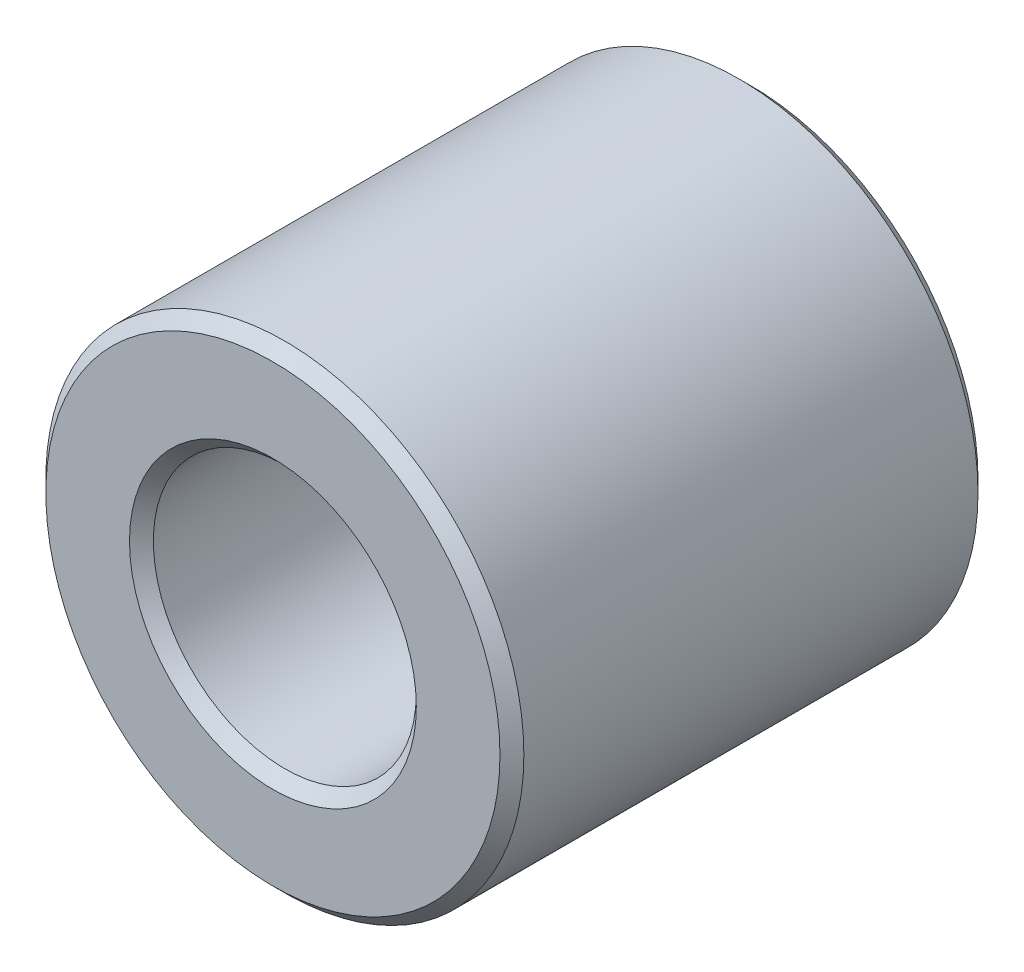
ISO-10303-21;
HEADER;
FILE_DESCRIPTION(('STEP AP214'),'2;1');
FILE_NAME('part.step','',(''),(''),'','','');
FILE_SCHEMA(('AUTOMOTIVE_DESIGN { 1 0 10303 214 1 1 1 1 }'));
ENDSEC;
DATA;
#1=APPLICATION_CONTEXT('core data for automotive mechanical design processes');
#2=APPLICATION_PROTOCOL_DEFINITION('international standard','automotive_design',2000,#1);
#3=PRODUCT_CONTEXT('',#1,'mechanical');
#4=PRODUCT('Part','Part','',(#3));
#5=PRODUCT_RELATED_PRODUCT_CATEGORY('part','',(#4));
#6=PRODUCT_DEFINITION_FORMATION('','',#4);
#7=PRODUCT_DEFINITION_CONTEXT('part definition',#1,'design');
#8=PRODUCT_DEFINITION('design','',#6,#7);
#9=PRODUCT_DEFINITION_SHAPE('','',#8);
#10=(LENGTH_UNIT() NAMED_UNIT(*) SI_UNIT(.MILLI.,.METRE.));
#11=(NAMED_UNIT(*) PLANE_ANGLE_UNIT() SI_UNIT($,.RADIAN.));
#12=(NAMED_UNIT(*) SI_UNIT($,.STERADIAN.) SOLID_ANGLE_UNIT());
#13=UNCERTAINTY_MEASURE_WITH_UNIT(LENGTH_MEASURE(1.E-05),#10,'distance_accuracy_value','');
#14=(GEOMETRIC_REPRESENTATION_CONTEXT(3) GLOBAL_UNCERTAINTY_ASSIGNED_CONTEXT((#13)) GLOBAL_UNIT_ASSIGNED_CONTEXT((#10,
#11,#12)) REPRESENTATION_CONTEXT('',''));
#15=CARTESIAN_POINT('',(0.,0.,0.));
#16=DIRECTION('',(0.,0.,1.));
#17=DIRECTION('',(1.,0.,0.));
#18=AXIS2_PLACEMENT_3D('',#15,#16,#17);
#19=CARTESIAN_POINT('',(0.,0.,2.));
#20=DIRECTION('',(0.,0.,1.));
#21=DIRECTION('',(1.,0.,0.));
#22=AXIS2_PLACEMENT_3D('',#19,#20,#21);
#23=PLANE('',#22);
#24=CARTESIAN_POINT('',(0.,0.,2.));
#25=DIRECTION('',(0.,0.,1.));
#26=DIRECTION('',(1.,0.,0.));
#27=AXIS2_PLACEMENT_3D('',#24,#25,#26);
#28=CIRCLE('',#27,1.2);
#29=CARTESIAN_POINT('',(1.2,0.,2.));
#30=VERTEX_POINT('',#29);
#31=EDGE_CURVE('E10',#30,#30,#28,.F.);
#32=ORIENTED_EDGE('',*,*,#31,.T.);
#33=EDGE_LOOP('',(#32));
#34=FACE_BOUND('',#33,.T.);
#35=CARTESIAN_POINT('',(0.,0.,2.));
#36=DIRECTION('',(0.,0.,1.));
#37=DIRECTION('',(1.,0.,0.));
#38=AXIS2_PLACEMENT_3D('',#35,#36,#37);
#39=CIRCLE('',#38,1.9);
#40=CARTESIAN_POINT('',(1.9,0.,2.));
#41=VERTEX_POINT('',#40);
#42=EDGE_CURVE('E45',#41,#41,#39,.T.);
#43=ORIENTED_EDGE('',*,*,#42,.T.);
#44=EDGE_LOOP('',(#43));
#45=FACE_BOUND('',#44,.T.);
#46=ADVANCED_FACE('F37',(#34,#45),#23,.T.);
#47=CARTESIAN_POINT('',(0.,0.,-2.));
#48=DIRECTION('',(0.,0.,1.));
#49=DIRECTION('',(1.,0.,0.));
#50=AXIS2_PLACEMENT_3D('',#47,#48,#49);
#51=PLANE('',#50);
#52=CARTESIAN_POINT('',(0.,0.,-2.));
#53=DIRECTION('',(0.,0.,1.));
#54=DIRECTION('',(1.,0.,0.));
#55=AXIS2_PLACEMENT_3D('',#52,#53,#54);
#56=CIRCLE('',#55,1.9);
#57=CARTESIAN_POINT('',(1.9,0.,-2.));
#58=VERTEX_POINT('',#57);
#59=EDGE_CURVE('E63',#58,#58,#56,.F.);
#60=ORIENTED_EDGE('',*,*,#59,.T.);
#61=EDGE_LOOP('',(#60));
#62=FACE_BOUND('',#61,.T.);
#63=CARTESIAN_POINT('',(0.,0.,-2.));
#64=DIRECTION('',(0.,0.,1.));
#65=DIRECTION('',(1.,0.,0.));
#66=AXIS2_PLACEMENT_3D('',#63,#64,#65);
#67=CIRCLE('',#66,1.2);
#68=CARTESIAN_POINT('',(1.2,0.,-2.));
#69=VERTEX_POINT('',#68);
#70=EDGE_CURVE('E67',#69,#69,#67,.T.);
#71=ORIENTED_EDGE('',*,*,#70,.T.);
#72=EDGE_LOOP('',(#71));
#73=FACE_BOUND('',#72,.T.);
#74=ADVANCED_FACE('F89',(#62,#73),#51,.F.);
#75=CARTESIAN_POINT('',(0.,0.,2.));
#76=DIRECTION('',(0.,0.,-1.));
#77=DIRECTION('',(-1.,0.,0.));
#78=AXIS2_PLACEMENT_3D('',#75,#76,#77);
#79=CYLINDRICAL_SURFACE('',#78,2.);
#80=CARTESIAN_POINT('',(0.,0.,-1.9));
#81=DIRECTION('',(0.,0.,1.));
#82=DIRECTION('',(1.,0.,0.));
#83=AXIS2_PLACEMENT_3D('',#80,#81,#82);
#84=CIRCLE('',#83,2.);
#85=CARTESIAN_POINT('',(2.,0.,-1.9));
#86=VERTEX_POINT('',#85);
#87=EDGE_CURVE('E70',#86,#86,#84,.T.);
#88=ORIENTED_EDGE('',*,*,#87,.T.);
#89=EDGE_LOOP('',(#88));
#90=FACE_BOUND('',#89,.T.);
#91=CARTESIAN_POINT('',(0.,0.,1.9));
#92=DIRECTION('',(0.,0.,1.));
#93=DIRECTION('',(1.,0.,0.));
#94=AXIS2_PLACEMENT_3D('',#91,#92,#93);
#95=CIRCLE('',#94,2.);
#96=CARTESIAN_POINT('',(2.,0.,1.9));
#97=VERTEX_POINT('',#96);
#98=EDGE_CURVE('E73',#97,#97,#95,.F.);
#99=ORIENTED_EDGE('',*,*,#98,.T.);
#100=EDGE_LOOP('',(#99));
#101=FACE_BOUND('',#100,.T.);
#102=ADVANCED_FACE('F78',(#90,#101),#79,.T.);
#103=CARTESIAN_POINT('',(0.,0.,2.));
#104=DIRECTION('',(0.,0.,-1.));
#105=DIRECTION('',(-1.,0.,0.));
#106=AXIS2_PLACEMENT_3D('',#103,#104,#105);
#107=CYLINDRICAL_SURFACE('',#106,1.1);
#108=CARTESIAN_POINT('',(0.,0.,-1.9));
#109=DIRECTION('',(0.,0.,1.));
#110=DIRECTION('',(1.,0.,0.));
#111=AXIS2_PLACEMENT_3D('',#108,#109,#110);
#112=CIRCLE('',#111,1.1);
#113=CARTESIAN_POINT('',(1.1,0.,-1.9));
#114=VERTEX_POINT('',#113);
#115=EDGE_CURVE('E51',#114,#114,#112,.F.);
#116=ORIENTED_EDGE('',*,*,#115,.T.);
#117=EDGE_LOOP('',(#116));
#118=FACE_BOUND('',#117,.T.);
#119=CARTESIAN_POINT('',(0.,0.,1.9));
#120=DIRECTION('',(0.,0.,1.));
#121=DIRECTION('',(1.,0.,0.));
#122=AXIS2_PLACEMENT_3D('',#119,#120,#121);
#123=CIRCLE('',#122,1.1);
#124=CARTESIAN_POINT('',(1.1,0.,1.9));
#125=VERTEX_POINT('',#124);
#126=EDGE_CURVE('E57',#125,#125,#123,.T.);
#127=ORIENTED_EDGE('',*,*,#126,.T.);
#128=EDGE_LOOP('',(#127));
#129=FACE_BOUND('',#128,.T.);
#130=ADVANCED_FACE('F97',(#118,#129),#107,.F.);
#131=CARTESIAN_POINT('',(0.,0.,-1.9));
#132=DIRECTION('',(0.,0.,1.));
#133=DIRECTION('',(1.,0.,0.));
#134=AXIS2_PLACEMENT_3D('',#131,#132,#133);
#135=CONICAL_SURFACE('',#134,2.,0.785398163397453);
#136=CARTESIAN_POINT('',(1.9,0.,-2.));
#137=CARTESIAN_POINT('',(1.90104166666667,0.,-1.99895833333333));
#138=CARTESIAN_POINT('',(1.90208333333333,0.,-1.99791666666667));
#139=CARTESIAN_POINT('',(1.90416666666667,0.,-1.99583333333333));
#140=CARTESIAN_POINT('',(1.90520833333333,0.,-1.99479166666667));
#141=CARTESIAN_POINT('',(1.90729166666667,0.,-1.99270833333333));
#142=CARTESIAN_POINT('',(1.90833333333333,0.,-1.99166666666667));
#143=CARTESIAN_POINT('',(1.91041666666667,0.,-1.98958333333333));
#144=CARTESIAN_POINT('',(1.91145833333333,0.,-1.98854166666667));
#145=CARTESIAN_POINT('',(1.91354166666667,0.,-1.98645833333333));
#146=CARTESIAN_POINT('',(1.91458333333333,0.,-1.98541666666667));
#147=CARTESIAN_POINT('',(1.91666666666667,0.,-1.98333333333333));
#148=CARTESIAN_POINT('',(1.91770833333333,0.,-1.98229166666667));
#149=CARTESIAN_POINT('',(1.91979166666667,0.,-1.98020833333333));
#150=CARTESIAN_POINT('',(1.92083333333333,0.,-1.97916666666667));
#151=CARTESIAN_POINT('',(1.92291666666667,0.,-1.97708333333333));
#152=CARTESIAN_POINT('',(1.92395833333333,0.,-1.97604166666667));
#153=CARTESIAN_POINT('',(1.92604166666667,0.,-1.97395833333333));
#154=CARTESIAN_POINT('',(1.92708333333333,0.,-1.97291666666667));
#155=CARTESIAN_POINT('',(1.92916666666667,0.,-1.97083333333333));
#156=CARTESIAN_POINT('',(1.93020833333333,0.,-1.96979166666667));
#157=CARTESIAN_POINT('',(1.93229166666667,0.,-1.96770833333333));
#158=CARTESIAN_POINT('',(1.93333333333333,0.,-1.96666666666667));
#159=CARTESIAN_POINT('',(1.93541666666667,0.,-1.96458333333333));
#160=CARTESIAN_POINT('',(1.93645833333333,0.,-1.96354166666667));
#161=CARTESIAN_POINT('',(1.93854166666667,0.,-1.96145833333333));
#162=CARTESIAN_POINT('',(1.93958333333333,0.,-1.96041666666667));
#163=CARTESIAN_POINT('',(1.94166666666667,0.,-1.95833333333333));
#164=CARTESIAN_POINT('',(1.94270833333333,0.,-1.95729166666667));
#165=CARTESIAN_POINT('',(1.94479166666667,0.,-1.95520833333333));
#166=CARTESIAN_POINT('',(1.94583333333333,0.,-1.95416666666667));
#167=CARTESIAN_POINT('',(1.94791666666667,0.,-1.95208333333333));
#168=CARTESIAN_POINT('',(1.94895833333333,0.,-1.95104166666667));
#169=CARTESIAN_POINT('',(1.95104166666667,0.,-1.94895833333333));
#170=CARTESIAN_POINT('',(1.95208333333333,0.,-1.94791666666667));
#171=CARTESIAN_POINT('',(1.95416666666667,0.,-1.94583333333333));
#172=CARTESIAN_POINT('',(1.95520833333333,0.,-1.94479166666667));
#173=CARTESIAN_POINT('',(1.95729166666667,0.,-1.94270833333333));
#174=CARTESIAN_POINT('',(1.95833333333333,0.,-1.94166666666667));
#175=CARTESIAN_POINT('',(1.96041666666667,0.,-1.93958333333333));
#176=CARTESIAN_POINT('',(1.96145833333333,0.,-1.93854166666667));
#177=CARTESIAN_POINT('',(1.96354166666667,0.,-1.93645833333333));
#178=CARTESIAN_POINT('',(1.96458333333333,0.,-1.93541666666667));
#179=CARTESIAN_POINT('',(1.96666666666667,0.,-1.93333333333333));
#180=CARTESIAN_POINT('',(1.96770833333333,0.,-1.93229166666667));
#181=CARTESIAN_POINT('',(1.96979166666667,0.,-1.93020833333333));
#182=CARTESIAN_POINT('',(1.97083333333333,0.,-1.92916666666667));
#183=CARTESIAN_POINT('',(1.97291666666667,0.,-1.92708333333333));
#184=CARTESIAN_POINT('',(1.97395833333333,0.,-1.92604166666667));
#185=CARTESIAN_POINT('',(1.97604166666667,0.,-1.92395833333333));
#186=CARTESIAN_POINT('',(1.97708333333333,0.,-1.92291666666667));
#187=CARTESIAN_POINT('',(1.97916666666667,0.,-1.92083333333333));
#188=CARTESIAN_POINT('',(1.98020833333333,0.,-1.91979166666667));
#189=CARTESIAN_POINT('',(1.98229166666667,0.,-1.91770833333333));
#190=CARTESIAN_POINT('',(1.98333333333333,0.,-1.91666666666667));
#191=CARTESIAN_POINT('',(1.98541666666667,0.,-1.91458333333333));
#192=CARTESIAN_POINT('',(1.98645833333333,0.,-1.91354166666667));
#193=CARTESIAN_POINT('',(1.98854166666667,0.,-1.91145833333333));
#194=CARTESIAN_POINT('',(1.98958333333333,0.,-1.91041666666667));
#195=CARTESIAN_POINT('',(1.99166666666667,0.,-1.90833333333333));
#196=CARTESIAN_POINT('',(1.99270833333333,0.,-1.90729166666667));
#197=CARTESIAN_POINT('',(1.99479166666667,0.,-1.90520833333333));
#198=CARTESIAN_POINT('',(1.99583333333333,0.,-1.90416666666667));
#199=CARTESIAN_POINT('',(1.99791666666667,0.,-1.90208333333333));
#200=CARTESIAN_POINT('',(1.99895833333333,0.,-1.90104166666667));
#201=CARTESIAN_POINT('',(2.,0.,-1.9));
#202=B_SPLINE_CURVE_WITH_KNOTS('',3,(#136,#137,#138,#139,#140,#141,#142,#143,#144,#145,#146,
#147,#148,#149,#150,#151,#152,#153,#154,#155,#156,#157,#158,#159,#160,#161,#162,#163,#164,#165,
#166,#167,#168,#169,#170,#171,#172,#173,#174,#175,#176,#177,#178,#179,#180,#181,#182,#183,#184,
#185,#186,#187,#188,#189,#190,#191,#192,#193,#194,#195,#196,#197,#198,#199,#200,#201),
.UNSPECIFIED.,.F.,.F.,(4,2,2,2,2,2,2,2,2,2,2,2,2,2,2,2,2,2,2,2,2,2,2,2,2,2,2,2,2,2,2,2,4),(0.,
0.0044194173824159,0.00883883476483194,0.013258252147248,0.017677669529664,0.0220970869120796,
0.0265165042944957,0.0309359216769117,0.0353553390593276,0.0397747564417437,0.0441941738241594,
0.0486135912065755,0.0530330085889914,0.0574524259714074,0.0618718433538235,0.066291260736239,
0.0707106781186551,0.0751300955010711,0.0795495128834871,0.0839689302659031,0.0883883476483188,
0.0928077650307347,0.0972271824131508,0.101646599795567,0.106066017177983,0.110485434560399,
0.114904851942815,0.11932426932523,0.123743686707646,0.128163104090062,0.132582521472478,
0.137001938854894,0.14142135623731),.UNSPECIFIED.);
#203=EDGE_CURVE('BSEAM102',#58,#86,#202,.T.);
#204=ORIENTED_EDGE('',*,*,#59,.F.);
#205=ORIENTED_EDGE('',*,*,#87,.F.);
#206=ORIENTED_EDGE('',*,*,#203,.T.);
#207=ORIENTED_EDGE('',*,*,#203,.F.);
#208=EDGE_LOOP('',(#204,#206,#205,#207));
#209=FACE_BOUND('',#208,.T.);
#210=ADVANCED_FACE('F102',(#209),#135,.T.);
#211=CARTESIAN_POINT('',(0.,0.,-2.));
#212=DIRECTION('',(0.,0.,-1.));
#213=DIRECTION('',(-1.,0.,0.));
#214=AXIS2_PLACEMENT_3D('',#211,#212,#213);
#215=CONICAL_SURFACE('',#214,1.2,0.785398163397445);
#216=ORIENTED_EDGE('',*,*,#115,.F.);
#217=EDGE_LOOP('',(#216));
#218=FACE_BOUND('',#217,.T.);
#219=ORIENTED_EDGE('',*,*,#70,.F.);
#220=EDGE_LOOP('',(#219));
#221=FACE_BOUND('',#220,.T.);
#222=ADVANCED_FACE('F86',(#218,#221),#215,.F.);
#223=CARTESIAN_POINT('',(0.,0.,1.9));
#224=DIRECTION('',(0.,0.,1.));
#225=DIRECTION('',(1.,0.,0.));
#226=AXIS2_PLACEMENT_3D('',#223,#224,#225);
#227=CONICAL_SURFACE('',#226,1.1,0.785398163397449);
#228=ORIENTED_EDGE('',*,*,#31,.F.);
#229=EDGE_LOOP('',(#228));
#230=FACE_BOUND('',#229,.T.);
#231=ORIENTED_EDGE('',*,*,#126,.F.);
#232=EDGE_LOOP('',(#231));
#233=FACE_BOUND('',#232,.T.);
#234=ADVANCED_FACE('F82',(#230,#233),#227,.F.);
#235=CARTESIAN_POINT('',(0.,0.,2.));
#236=DIRECTION('',(0.,0.,-1.));
#237=DIRECTION('',(-1.,0.,0.));
#238=AXIS2_PLACEMENT_3D('',#235,#236,#237);
#239=CONICAL_SURFACE('',#238,1.9,0.785398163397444);
#240=ORIENTED_EDGE('',*,*,#98,.F.);
#241=EDGE_LOOP('',(#240));
#242=FACE_BOUND('',#241,.T.);
#243=ORIENTED_EDGE('',*,*,#42,.F.);
#244=EDGE_LOOP('',(#243));
#245=FACE_BOUND('',#244,.T.);
#246=ADVANCED_FACE('F39',(#242,#245),#239,.T.);
#247=CLOSED_SHELL('',(#46,#74,#102,#130,#210,#222,#234,#246));
#248=MANIFOLD_SOLID_BREP('B2',#247);
#249=ADVANCED_BREP_SHAPE_REPRESENTATION('',(#18,#248),#14);
#250=SHAPE_DEFINITION_REPRESENTATION(#9,#249);
ENDSEC;
END-ISO-10303-21;
